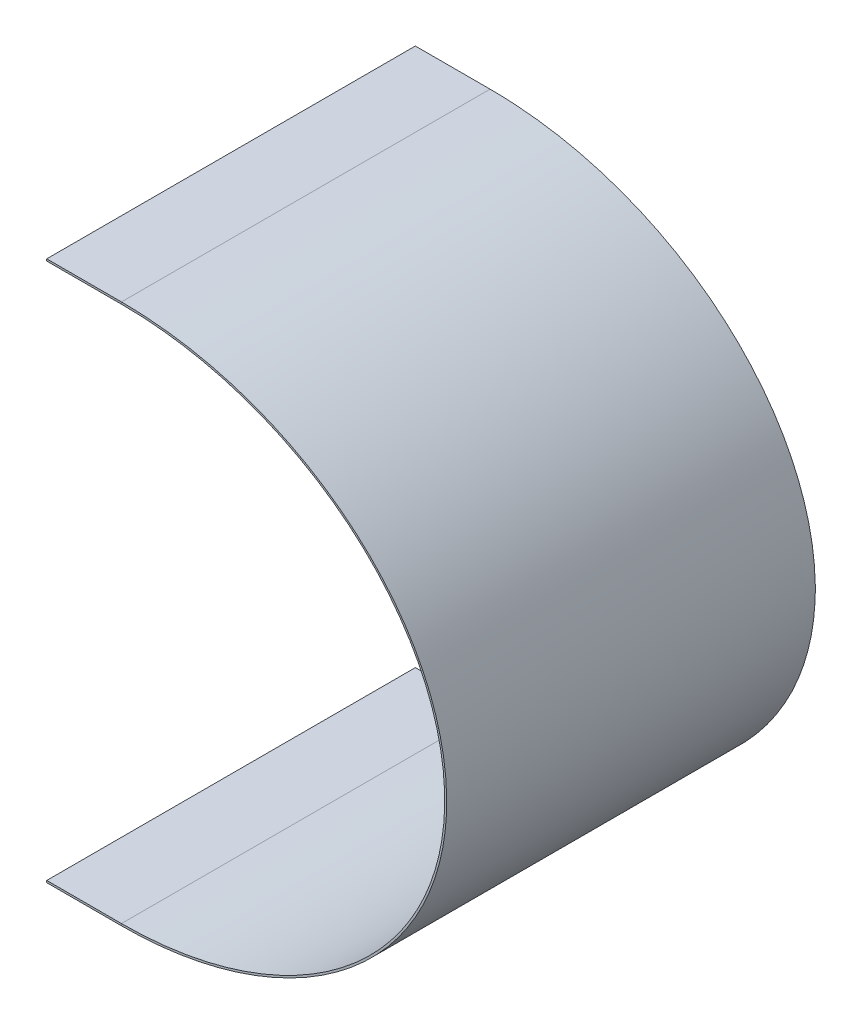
ISO-10303-21;
HEADER;
FILE_DESCRIPTION(('STEP AP214'),'2;1');
FILE_NAME('part.step','',(''),(''),'','','');
FILE_SCHEMA(('AUTOMOTIVE_DESIGN { 1 0 10303 214 1 1 1 1 }'));
ENDSEC;
DATA;
#1=APPLICATION_CONTEXT('core data for automotive mechanical design processes');
#2=APPLICATION_PROTOCOL_DEFINITION('international standard','automotive_design',2000,#1);
#3=PRODUCT_CONTEXT('',#1,'mechanical');
#4=PRODUCT('Part','Part','',(#3));
#5=PRODUCT_RELATED_PRODUCT_CATEGORY('part','',(#4));
#6=PRODUCT_DEFINITION_FORMATION('','',#4);
#7=PRODUCT_DEFINITION_CONTEXT('part definition',#1,'design');
#8=PRODUCT_DEFINITION('design','',#6,#7);
#9=PRODUCT_DEFINITION_SHAPE('','',#8);
#10=(LENGTH_UNIT() NAMED_UNIT(*) SI_UNIT(.MILLI.,.METRE.));
#11=(NAMED_UNIT(*) PLANE_ANGLE_UNIT() SI_UNIT($,.RADIAN.));
#12=(NAMED_UNIT(*) SI_UNIT($,.STERADIAN.) SOLID_ANGLE_UNIT());
#13=UNCERTAINTY_MEASURE_WITH_UNIT(LENGTH_MEASURE(1.E-05),#10,'distance_accuracy_value','');
#14=(GEOMETRIC_REPRESENTATION_CONTEXT(3) GLOBAL_UNCERTAINTY_ASSIGNED_CONTEXT((#13)) GLOBAL_UNIT_ASSIGNED_CONTEXT((#10,
#11,#12)) REPRESENTATION_CONTEXT('',''));
#15=CARTESIAN_POINT('',(0.,0.,0.));
#16=DIRECTION('',(0.,0.,1.));
#17=DIRECTION('',(1.,0.,0.));
#18=AXIS2_PLACEMENT_3D('',#15,#16,#17);
#19=CARTESIAN_POINT('',(0.,-161.52197322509,0.));
#20=DIRECTION('',(0.,0.,1.));
#21=DIRECTION('',(-1.,0.,0.));
#22=AXIS2_PLACEMENT_3D('',#19,#20,#21);
#23=PLANE('',#22);
#24=DIRECTION('',(0.,-1.,0.));
#25=VECTOR('',#24,1.);
#26=CARTESIAN_POINT('',(-45.,-161.52197322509,0.));
#27=LINE('',#26,#25);
#28=CARTESIAN_POINT('',(-45.,-161.52197322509,0.));
#29=VERTEX_POINT('',#28);
#30=CARTESIAN_POINT('',(-45.,-162.71197322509,0.));
#31=VERTEX_POINT('',#30);
#32=EDGE_CURVE('E14',#29,#31,#27,.T.);
#33=ORIENTED_EDGE('',*,*,#32,.F.);
#34=DIRECTION('',(-1.,0.,0.));
#35=VECTOR('',#34,1.);
#36=CARTESIAN_POINT('',(0.,-161.52197322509,0.));
#37=LINE('',#36,#35);
#38=CARTESIAN_POINT('',(0.,-161.52197322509,0.));
#39=VERTEX_POINT('',#38);
#40=EDGE_CURVE('E201',#39,#29,#37,.T.);
#41=ORIENTED_EDGE('',*,*,#40,.F.);
#42=DIRECTION('',(0.,-1.,0.));
#43=VECTOR('',#42,1.);
#44=CARTESIAN_POINT('',(0.,-161.52197322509,0.));
#45=LINE('',#44,#43);
#46=CARTESIAN_POINT('',(0.,-162.71197322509,0.));
#47=VERTEX_POINT('',#46);
#48=EDGE_CURVE('E69',#39,#47,#45,.T.);
#49=ORIENTED_EDGE('',*,*,#48,.T.);
#50=DIRECTION('',(1.,0.,0.));
#51=VECTOR('',#50,1.);
#52=CARTESIAN_POINT('',(0.,-162.71197322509,0.));
#53=LINE('',#52,#51);
#54=EDGE_CURVE('E117',#47,#31,#53,.F.);
#55=ORIENTED_EDGE('',*,*,#54,.T.);
#56=EDGE_LOOP('',(#33,#41,#49,#55));
#57=FACE_BOUND('',#56,.T.);
#58=ADVANCED_FACE('F59',(#57),#23,.F.);
#59=CARTESIAN_POINT('',(0.,-161.52197322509,0.));
#60=DIRECTION('',(0.,0.,-1.));
#61=DIRECTION('',(-1.,0.,0.));
#62=AXIS2_PLACEMENT_3D('',#59,#60,#61);
#63=PLANE('',#62);
#64=ORIENTED_EDGE('',*,*,#48,.F.);
#65=CARTESIAN_POINT('',(0.,-161.52197322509,0.));
#66=CARTESIAN_POINT('',(51.6352629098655,-161.52197322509,0.));
#67=CARTESIAN_POINT('',(101.159576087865,-144.503671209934,0.));
#68=CARTESIAN_POINT('',(174.182865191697,-83.9228939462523,0.));
#69=CARTESIAN_POINT('',(194.696507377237,-42.8370784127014,0.));
#70=CARTESIAN_POINT('',(194.696507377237,42.8370784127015,0.));
#71=CARTESIAN_POINT('',(174.182865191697,83.9228939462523,0.));
#72=CARTESIAN_POINT('',(101.159576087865,144.503671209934,0.));
#73=CARTESIAN_POINT('',(51.6352629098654,161.52197322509,0.));
#74=CARTESIAN_POINT('',(0.,161.52197322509,0.));
#75=B_SPLINE_CURVE_WITH_KNOTS('',3,(#65,#66,#67,#68,#69,#70,#71,#72,#73,#74),.UNSPECIFIED.,.F.,
.F.,(4,2,2,2,4),(0.,0.25,0.5,0.75,1.),.UNSPECIFIED.);
#76=CARTESIAN_POINT('',(0.,161.52197322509,0.));
#77=VERTEX_POINT('',#76);
#78=EDGE_CURVE('E147',#39,#77,#75,.T.);
#79=ORIENTED_EDGE('',*,*,#78,.T.);
#80=DIRECTION('',(0.,1.,0.));
#81=VECTOR('',#80,1.);
#82=CARTESIAN_POINT('',(0.,161.52197322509,0.));
#83=LINE('',#82,#81);
#84=CARTESIAN_POINT('',(0.,162.71197322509,0.));
#85=VERTEX_POINT('',#84);
#86=EDGE_CURVE('E138',#77,#85,#83,.T.);
#87=ORIENTED_EDGE('',*,*,#86,.T.);
#88=CARTESIAN_POINT('',(-2.665259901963E-11,-162.71197322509,7.43899436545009E-11));
#89=CARTESIAN_POINT('',(3.23528703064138,-162.711974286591,-3.34634409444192E-12));
#90=CARTESIAN_POINT('',(6.4705901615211,-162.645497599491,-1.40137352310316E-11));
#91=CARTESIAN_POINT('',(12.9192802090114,-162.380074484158,1.39425046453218E-11));
#92=CARTESIAN_POINT('',(16.1326949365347,-162.181803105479,5.23158693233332E-11));
#93=CARTESIAN_POINT('',(22.5322733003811,-161.654626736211,9.43273594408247E-11));
#94=CARTESIAN_POINT('',(25.7184922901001,-161.326394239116,9.81419225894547E-11));
#95=CARTESIAN_POINT('',(32.0583321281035,-160.541124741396,4.96351336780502E-11));
#96=CARTESIAN_POINT('',(35.2120363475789,-160.08476121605,-2.3966142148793E-12));
#97=CARTESIAN_POINT('',(41.4815034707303,-159.04505086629,-3.6852034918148E-12));
#98=CARTESIAN_POINT('',(44.5973785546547,-158.462380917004,4.65216563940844E-11));
#99=CARTESIAN_POINT('',(50.7858423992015,-157.171872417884,9.89853341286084E-11));
#100=CARTESIAN_POINT('',(53.8585731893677,-156.464715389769,1.01495512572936E-10));
#101=CARTESIAN_POINT('',(59.9554018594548,-154.927041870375,2.47822955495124E-11));
#102=CARTESIAN_POINT('',(62.9796726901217,-154.097211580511,-5.4000161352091E-11));
#103=CARTESIAN_POINT('',(68.9742321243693,-152.315996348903,-1.09652866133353E-10));
#104=CARTESIAN_POINT('',(71.9447255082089,-151.365301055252,-8.70781507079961E-11));
#105=CARTESIAN_POINT('',(77.8263774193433,-149.344157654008,-5.37183525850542E-11));
#106=CARTESIAN_POINT('',(80.7377730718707,-148.274400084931,-4.2868831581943E-11));
#107=CARTESIAN_POINT('',(86.495873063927,-146.016932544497,1.55538105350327E-11));
#108=CARTESIAN_POINT('',(89.3428467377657,-144.829910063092,6.2922809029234E-11));
#109=CARTESIAN_POINT('',(94.9667422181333,-142.339713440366,7.30892420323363E-11));
#110=CARTESIAN_POINT('',(97.7439644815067,-141.037218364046,3.63531987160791E-11));
#111=CARTESIAN_POINT('',(103.222992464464,-138.317879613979,-3.61545365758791E-11));
#112=CARTESIAN_POINT('',(105.925127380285,-136.901699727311,-7.19304014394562E-11));
#113=CARTESIAN_POINT('',(111.248612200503,-133.956799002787,-5.82935766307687E-11));
#114=CARTESIAN_POINT('',(113.870315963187,-132.428718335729,-9.33398899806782E-12));
#115=CARTESIAN_POINT('',(119.027566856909,-129.261830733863,9.28621400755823E-12));
#116=CARTESIAN_POINT('',(121.563486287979,-127.623630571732,-2.06485702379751E-11));
#117=CARTESIAN_POINT('',(126.543795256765,-124.238328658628,-4.08252787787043E-11));
#118=CARTESIAN_POINT('',(128.988566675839,-122.49178917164,-3.12576056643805E-11));
#119=CARTESIAN_POINT('',(133.781205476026,-118.89164546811,-2.82272890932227E-11));
#120=CARTESIAN_POINT('',(136.129452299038,-117.03854679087,-3.46938848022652E-11));
#121=CARTESIAN_POINT('',(140.712044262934,-113.236787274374,-2.26129661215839E-11));
#122=CARTESIAN_POINT('',(142.947219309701,-111.28912762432,-4.28832055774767E-12));
#123=CARTESIAN_POINT('',(147.288611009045,-107.311436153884,4.23117053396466E-12));
#124=CARTESIAN_POINT('',(149.396149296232,-105.282848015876,-5.20235544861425E-12));
#125=CARTESIAN_POINT('',(153.479997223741,-101.147847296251,5.13670465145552E-12));
#126=CARTESIAN_POINT('',(155.457627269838,-99.0427398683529,2.45422283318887E-11));
#127=CARTESIAN_POINT('',(159.279398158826,-94.759253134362,2.49800605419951E-11));
#128=CARTESIAN_POINT('',(161.124844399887,-92.5820394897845,6.46491613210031E-12));
#129=CARTESIAN_POINT('',(164.679997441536,-88.1588981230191,-6.39344766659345E-12));
#130=CARTESIAN_POINT('',(166.390979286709,-85.9139960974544,-1.00162054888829E-12));
#131=CARTESIAN_POINT('',(169.674965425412,-81.3600416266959,9.9142115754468E-13));
#132=CARTESIAN_POINT('',(171.249197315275,-79.0518751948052,-2.31840950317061E-12));
#133=CARTESIAN_POINT('',(174.257459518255,-74.3759618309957,2.29698481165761E-12));
#134=CARTESIAN_POINT('',(175.692651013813,-72.008962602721,1.01186679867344E-11));
#135=CARTESIAN_POINT('',(178.420624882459,-67.2199600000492,-1.00354714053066E-11));
#136=CARTESIAN_POINT('',(179.714481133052,-64.7985688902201,-3.77174924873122E-11));
#137=CARTESIAN_POINT('',(182.157596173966,-59.9053651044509,-7.86319046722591E-11));
#138=CARTESIAN_POINT('',(183.307818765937,-57.4340340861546,-9.19657581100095E-11));
#139=CARTESIAN_POINT('',(185.461500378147,-52.4455385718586,-4.47680884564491E-11));
#140=CARTESIAN_POINT('',(186.465788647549,-49.9287324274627,1.53262203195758E-11));
#141=CARTESIAN_POINT('',(188.325460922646,-44.8538788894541,-1.52551558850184E-11));
#142=CARTESIAN_POINT('',(189.181513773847,-42.2960768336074,-1.05233044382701E-10));
#143=CARTESIAN_POINT('',(190.742603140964,-37.1438257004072,-1.7942120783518E-10));
#144=CARTESIAN_POINT('',(191.448121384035,-34.54952273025,-1.63974252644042E-10));
#145=CARTESIAN_POINT('',(192.706061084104,-29.3288629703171,-1.16635163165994E-10));
#146=CARTESIAN_POINT('',(193.258750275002,-26.7025707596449,-8.47720716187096E-11));
#147=CARTESIAN_POINT('',(194.208985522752,-21.4225207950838,-6.165750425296E-11));
#148=CARTESIAN_POINT('',(194.606559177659,-18.7687680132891,-7.03988005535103E-11));
#149=CARTESIAN_POINT('',(195.244552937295,-13.4383753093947,-7.73319158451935E-11));
#150=CARTESIAN_POINT('',(195.484736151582,-10.7617070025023,-7.55078732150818E-11));
#151=CARTESIAN_POINT('',(195.805974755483,-5.39004666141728,-7.30025924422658E-11));
#152=CARTESIAN_POINT('',(195.886507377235,-2.69502333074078,-7.23251097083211E-11));
#153=CARTESIAN_POINT('',(195.886507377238,2.69502333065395,-7.64547776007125E-11));
#154=CARTESIAN_POINT('',(195.805974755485,5.39004666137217,-8.12619282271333E-11));
#155=CARTESIAN_POINT('',(195.484736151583,10.7617070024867,-6.72754498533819E-11));
#156=CARTESIAN_POINT('',(195.244552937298,13.4383753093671,-4.85586711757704E-11));
#157=CARTESIAN_POINT('',(194.606559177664,18.7687680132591,-9.91289018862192E-11));
#158=CARTESIAN_POINT('',(194.208985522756,21.4225207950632,-1.68283998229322E-10));
#159=CARTESIAN_POINT('',(193.258750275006,26.7025707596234,-1.24567147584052E-10));
#160=CARTESIAN_POINT('',(192.706061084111,29.3288629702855,-1.16627917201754E-11));
#161=CARTESIAN_POINT('',(191.448121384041,34.5495227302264,2.04040140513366E-11));
#162=CARTESIAN_POINT('',(190.742603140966,37.1438257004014,-6.0776080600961E-11));
#163=CARTESIAN_POINT('',(189.181513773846,42.2960768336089,-8.1645382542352E-11));
#164=CARTESIAN_POINT('',(188.325460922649,44.8538788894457,-2.08724153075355E-11));
#165=CARTESIAN_POINT('',(186.465788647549,49.9287324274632,2.09696471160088E-11));
#166=CARTESIAN_POINT('',(185.46150037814,52.4455385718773,1.6661319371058E-12));
#167=CARTESIAN_POINT('',(183.307818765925,57.4340340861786,-1.67606329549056E-12));
#168=CARTESIAN_POINT('',(182.15759617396,59.9053651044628,1.44961465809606E-11));
#169=CARTESIAN_POINT('',(179.714481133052,64.798568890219,2.07461309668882E-12));
#170=CARTESIAN_POINT('',(178.420624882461,67.219960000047,-2.68409301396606E-11));
#171=CARTESIAN_POINT('',(175.69265101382,72.0089626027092,-6.57765388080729E-11));
#172=CARTESIAN_POINT('',(174.257459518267,74.3759618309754,-7.56379686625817E-11));
#173=CARTESIAN_POINT('',(171.249197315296,79.0518751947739,-4.93622610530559E-11));
#174=CARTESIAN_POINT('',(169.674965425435,81.3600416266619,-1.2795222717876E-11));
#175=CARTESIAN_POINT('',(166.39097928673,85.9139960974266,1.29268554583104E-11));
#176=CARTESIAN_POINT('',(164.679997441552,88.1588981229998,1.59026727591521E-12));
#177=CARTESIAN_POINT('',(161.124844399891,92.5820394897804,-1.60804390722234E-12));
#178=CARTESIAN_POINT('',(159.279398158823,94.7592531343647,6.7493473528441E-12));
#179=CARTESIAN_POINT('',(155.457627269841,99.0427398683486,-6.83038641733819E-12));
#180=CARTESIAN_POINT('',(153.479997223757,101.147847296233,-2.91324609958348E-11));
#181=CARTESIAN_POINT('',(149.396149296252,105.282848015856,-2.31024937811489E-11));
#182=CARTESIAN_POINT('',(147.288611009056,107.311436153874,5.88033158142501E-12));
#183=CARTESIAN_POINT('',(142.947219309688,111.289127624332,-5.95975666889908E-12));
#184=CARTESIAN_POINT('',(140.712044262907,113.236787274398,-4.77308173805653E-11));
#185=CARTESIAN_POINT('',(136.129452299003,117.038546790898,-4.72617310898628E-11));
#186=CARTESIAN_POINT('',(133.781205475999,118.891645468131,-4.26118338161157E-12));
#187=CARTESIAN_POINT('',(128.988566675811,122.491789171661,4.28003797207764E-12));
#188=CARTESIAN_POINT('',(126.543795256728,124.238328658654,-3.05228693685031E-11));
#189=CARTESIAN_POINT('',(121.563486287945,127.623630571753,-7.29211235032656E-11));
#190=CARTESIAN_POINT('',(119.02756685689,129.261830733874,-8.03840346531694E-11));
#191=CARTESIAN_POINT('',(113.870315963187,132.428718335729,-8.53398144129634E-11));
#192=CARTESIAN_POINT('',(111.248612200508,133.956799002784,-8.27811923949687E-11));
#193=CARTESIAN_POINT('',(105.925127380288,136.901699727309,-4.73115487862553E-11));
#194=CARTESIAN_POINT('',(103.222992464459,138.317879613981,-1.42379325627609E-11));
#195=CARTESIAN_POINT('',(97.7439644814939,141.037218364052,1.43161672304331E-11));
#196=CARTESIAN_POINT('',(94.9667422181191,142.339713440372,9.58908526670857E-12));
#197=CARTESIAN_POINT('',(89.3428467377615,144.829910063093,-3.98447645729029E-11));
#198=CARTESIAN_POINT('',(86.4958730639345,146.016932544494,-8.47738426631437E-11));
#199=CARTESIAN_POINT('',(80.7377730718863,148.274400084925,-8.0882884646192E-11));
#200=CARTESIAN_POINT('',(77.826377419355,149.344157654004,-3.15383089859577E-11));
#201=CARTESIAN_POINT('',(71.9447255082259,151.365301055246,7.47090429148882E-12));
#202=CARTESIAN_POINT('',(68.9742321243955,152.315996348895,-3.197490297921E-12));
#203=CARTESIAN_POINT('',(62.9796726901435,154.097211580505,-1.80317134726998E-11));
#204=CARTESIAN_POINT('',(59.9554018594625,154.927041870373,-2.21614590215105E-11));
#205=CARTESIAN_POINT('',(53.8585731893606,156.464715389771,1.31609517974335E-11));
#206=CARTESIAN_POINT('',(50.7858423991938,157.171872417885,5.28496612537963E-11));
#207=CARTESIAN_POINT('',(44.597378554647,158.462380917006,8.52904014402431E-11));
#208=CARTESIAN_POINT('',(41.4815034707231,159.045050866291,7.77905738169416E-11));
#209=CARTESIAN_POINT('',(35.2120363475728,160.084761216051,6.89615417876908E-11));
#210=CARTESIAN_POINT('',(32.058332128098,160.541124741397,6.7664999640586E-11));
#211=CARTESIAN_POINT('',(25.718492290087,161.326394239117,7.77265308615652E-11));
#212=CARTESIAN_POINT('',(22.5322733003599,161.654626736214,8.91502857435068E-11));
#213=CARTESIAN_POINT('',(16.1326949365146,162.18180310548,5.90502739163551E-11));
#214=CARTESIAN_POINT('',(12.9192802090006,162.380074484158,1.72543438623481E-11));
#215=CARTESIAN_POINT('',(6.4705901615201,162.645497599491,-1.73424942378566E-11));
#216=CARTESIAN_POINT('',(3.23528703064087,162.711974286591,-9.8920016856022E-12));
#217=CARTESIAN_POINT('',(-2.66883641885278E-11,162.71197322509,7.43899436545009E-11));
#218=B_SPLINE_CURVE_WITH_KNOTS('',3,(#88,#89,#90,#91,#92,#93,#94,#95,#96,#97,#98,#99,#100,#101,
#102,#103,#104,#105,#106,#107,#108,#109,#110,#111,#112,#113,#114,#115,#116,#117,#118,#119,#120,
#121,#122,#123,#124,#125,#126,#127,#128,#129,#130,#131,#132,#133,#134,#135,#136,#137,#138,#139,
#140,#141,#142,#143,#144,#145,#146,#147,#148,#149,#150,#151,#152,#153,#154,#155,#156,#157,#158,
#159,#160,#161,#162,#163,#164,#165,#166,#167,#168,#169,#170,#171,#172,#173,#174,#175,#176,#177,
#178,#179,#180,#181,#182,#183,#184,#185,#186,#187,#188,#189,#190,#191,#192,#193,#194,#195,#196,
#197,#198,#199,#200,#201,#202,#203,#204,#205,#206,#207,#208,#209,#210,#211,#212,#213,#214,#215,
#216,#217),.UNSPECIFIED.,.F.,.F.,(4,2,2,2,2,2,2,2,2,2,2,2,2,2,2,2,2,2,2,2,2,2,2,2,2,2,2,2,2,2,2,
2,2,2,2,2,2,2,2,2,2,2,2,2,2,2,2,2,2,2,2,2,2,2,2,2,2,2,2,2,2,2,2,2,4),(0.,9.70520179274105,
19.3610728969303,28.9676186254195,38.5245869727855,48.0315528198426,57.4880042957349,
66.8934313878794,76.2474169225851,85.5497300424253,94.8004222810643,103.999926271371,
113.149157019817,122.249615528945,131.303494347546,140.313784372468,149.284381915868,
158.174868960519,166.946873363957,175.608180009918,184.166724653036,192.630656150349,
201.008400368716,209.308724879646,217.540803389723,225.714278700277,233.839322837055,
241.926692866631,249.987780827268,258.034656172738,266.080099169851,274.137623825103,
282.221489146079,290.30535446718,298.362879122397,306.408322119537,314.455197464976,
322.516285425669,330.603655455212,338.72869959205,346.902174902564,355.134253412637,
363.434577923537,371.812322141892,380.276253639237,388.834798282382,397.496104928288,
406.268109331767,415.158596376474,424.129193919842,433.139483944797,442.193362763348,
451.293821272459,460.443052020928,469.64255601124,478.893248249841,488.195561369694,
497.54954690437,506.954973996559,516.411425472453,525.918391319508,535.475359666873,
545.081905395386,554.737776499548,564.442978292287),.UNSPECIFIED.);
#219=EDGE_CURVE('E126',#47,#85,#218,.T.);
#220=ORIENTED_EDGE('',*,*,#219,.F.);
#221=EDGE_LOOP('',(#64,#79,#87,#220));
#222=FACE_BOUND('',#221,.T.);
#223=ADVANCED_FACE('F144',(#222),#63,.T.);
#224=CARTESIAN_POINT('',(0.,161.52197322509,0.));
#225=DIRECTION('',(0.,0.,1.));
#226=DIRECTION('',(1.,0.,0.));
#227=AXIS2_PLACEMENT_3D('',#224,#225,#226);
#228=PLANE('',#227);
#229=ORIENTED_EDGE('',*,*,#86,.F.);
#230=DIRECTION('',(1.,0.,0.));
#231=VECTOR('',#230,1.);
#232=CARTESIAN_POINT('',(0.,161.52197322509,0.));
#233=LINE('',#232,#231);
#234=CARTESIAN_POINT('',(-45.0000000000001,161.52197322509,0.));
#235=VERTEX_POINT('',#234);
#236=EDGE_CURVE('E237',#235,#77,#233,.T.);
#237=ORIENTED_EDGE('',*,*,#236,.F.);
#238=DIRECTION('',(0.,1.,0.));
#239=VECTOR('',#238,1.);
#240=CARTESIAN_POINT('',(-45.0000000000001,161.52197322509,0.));
#241=LINE('',#240,#239);
#242=CARTESIAN_POINT('',(-45.0000000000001,162.71197322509,0.));
#243=VERTEX_POINT('',#242);
#244=EDGE_CURVE('E136',#235,#243,#241,.T.);
#245=ORIENTED_EDGE('',*,*,#244,.T.);
#246=DIRECTION('',(1.,0.,0.));
#247=VECTOR('',#246,1.);
#248=CARTESIAN_POINT('',(-45.0000000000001,162.71197322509,0.));
#249=LINE('',#248,#247);
#250=EDGE_CURVE('E159',#243,#85,#249,.T.);
#251=ORIENTED_EDGE('',*,*,#250,.T.);
#252=EDGE_LOOP('',(#229,#237,#245,#251));
#253=FACE_BOUND('',#252,.T.);
#254=ADVANCED_FACE('F160',(#253),#228,.F.);
#255=CARTESIAN_POINT('',(-45.0000000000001,161.52197322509,0.));
#256=DIRECTION('',(-1.,0.,0.));
#257=DIRECTION('',(0.,0.,1.));
#258=AXIS2_PLACEMENT_3D('',#255,#256,#257);
#259=PLANE('',#258);
#260=ORIENTED_EDGE('',*,*,#244,.F.);
#261=DIRECTION('',(0.,0.,1.));
#262=VECTOR('',#261,1.);
#263=CARTESIAN_POINT('',(-45.0000000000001,161.52197322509,0.));
#264=LINE('',#263,#262);
#265=CARTESIAN_POINT('',(-45.0000000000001,161.52197322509,222.));
#266=VERTEX_POINT('',#265);
#267=EDGE_CURVE('E230',#235,#266,#264,.T.);
#268=ORIENTED_EDGE('',*,*,#267,.T.);
#269=DIRECTION('',(0.,1.,0.));
#270=VECTOR('',#269,1.);
#271=CARTESIAN_POINT('',(-45.0000000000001,161.52197322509,222.));
#272=LINE('',#271,#270);
#273=CARTESIAN_POINT('',(-45.0000000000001,162.71197322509,222.));
#274=VERTEX_POINT('',#273);
#275=EDGE_CURVE('E134',#266,#274,#272,.T.);
#276=ORIENTED_EDGE('',*,*,#275,.T.);
#277=DIRECTION('',(0.,0.,1.));
#278=VECTOR('',#277,1.);
#279=CARTESIAN_POINT('',(-45.0000000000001,162.71197322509,222.));
#280=LINE('',#279,#278);
#281=EDGE_CURVE('E200',#243,#274,#280,.T.);
#282=ORIENTED_EDGE('',*,*,#281,.F.);
#283=EDGE_LOOP('',(#260,#268,#276,#282));
#284=FACE_BOUND('',#283,.T.);
#285=ADVANCED_FACE('F256',(#284),#259,.T.);
#286=CARTESIAN_POINT('',(0.,161.52197322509,222.));
#287=DIRECTION('',(0.,0.,1.));
#288=DIRECTION('',(1.,0.,0.));
#289=AXIS2_PLACEMENT_3D('',#286,#287,#288);
#290=PLANE('',#289);
#291=ORIENTED_EDGE('',*,*,#275,.F.);
#292=DIRECTION('',(1.,0.,0.));
#293=VECTOR('',#292,1.);
#294=CARTESIAN_POINT('',(0.,161.52197322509,222.));
#295=LINE('',#294,#293);
#296=CARTESIAN_POINT('',(0.,161.52197322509,222.));
#297=VERTEX_POINT('',#296);
#298=EDGE_CURVE('E244',#266,#297,#295,.T.);
#299=ORIENTED_EDGE('',*,*,#298,.T.);
#300=DIRECTION('',(0.,1.,0.));
#301=VECTOR('',#300,1.);
#302=CARTESIAN_POINT('',(0.,161.52197322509,222.));
#303=LINE('',#302,#301);
#304=CARTESIAN_POINT('',(0.,162.71197322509,222.));
#305=VERTEX_POINT('',#304);
#306=EDGE_CURVE('E132',#297,#305,#303,.T.);
#307=ORIENTED_EDGE('',*,*,#306,.T.);
#308=DIRECTION('',(1.,0.,0.));
#309=VECTOR('',#308,1.);
#310=CARTESIAN_POINT('',(-45.0000000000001,162.71197322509,222.));
#311=LINE('',#310,#309);
#312=EDGE_CURVE('E166',#274,#305,#311,.T.);
#313=ORIENTED_EDGE('',*,*,#312,.F.);
#314=EDGE_LOOP('',(#291,#299,#307,#313));
#315=FACE_BOUND('',#314,.T.);
#316=ADVANCED_FACE('F286',(#315),#290,.T.);
#317=CARTESIAN_POINT('',(0.,161.52197322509,222.));
#318=DIRECTION('',(0.,0.,-1.));
#319=DIRECTION('',(-1.,0.,0.));
#320=AXIS2_PLACEMENT_3D('',#317,#318,#319);
#321=PLANE('',#320);
#322=ORIENTED_EDGE('',*,*,#306,.F.);
#323=CARTESIAN_POINT('',(0.,-161.52197322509,222.));
#324=CARTESIAN_POINT('',(51.6352629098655,-161.52197322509,222.));
#325=CARTESIAN_POINT('',(101.159576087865,-144.503671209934,222.));
#326=CARTESIAN_POINT('',(174.182865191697,-83.9228939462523,222.));
#327=CARTESIAN_POINT('',(194.696507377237,-42.8370784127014,222.));
#328=CARTESIAN_POINT('',(194.696507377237,42.8370784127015,222.));
#329=CARTESIAN_POINT('',(174.182865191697,83.9228939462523,222.));
#330=CARTESIAN_POINT('',(101.159576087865,144.503671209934,222.));
#331=CARTESIAN_POINT('',(51.6352629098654,161.52197322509,222.));
#332=CARTESIAN_POINT('',(0.,161.52197322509,222.));
#333=B_SPLINE_CURVE_WITH_KNOTS('',3,(#323,#324,#325,#326,#327,#328,#329,#330,#331,#332),
.UNSPECIFIED.,.F.,.F.,(4,2,2,2,4),(0.,0.25,0.5,0.75,1.),.UNSPECIFIED.);
#334=CARTESIAN_POINT('',(0.,-161.52197322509,222.));
#335=VERTEX_POINT('',#334);
#336=EDGE_CURVE('E226',#297,#335,#333,.F.);
#337=ORIENTED_EDGE('',*,*,#336,.T.);
#338=DIRECTION('',(0.,-1.,0.));
#339=VECTOR('',#338,1.);
#340=CARTESIAN_POINT('',(0.,-161.52197322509,222.));
#341=LINE('',#340,#339);
#342=CARTESIAN_POINT('',(0.,-162.71197322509,222.));
#343=VERTEX_POINT('',#342);
#344=EDGE_CURVE('E76',#335,#343,#341,.T.);
#345=ORIENTED_EDGE('',*,*,#344,.T.);
#346=CARTESIAN_POINT('',(-2.665259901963E-11,-162.71197322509,222.));
#347=CARTESIAN_POINT('',(3.23528703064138,-162.711974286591,222.));
#348=CARTESIAN_POINT('',(6.4705901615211,-162.645497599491,222.));
#349=CARTESIAN_POINT('',(12.9192802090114,-162.380074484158,222.));
#350=CARTESIAN_POINT('',(16.1326949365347,-162.181803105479,222.));
#351=CARTESIAN_POINT('',(22.5322733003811,-161.654626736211,222.));
#352=CARTESIAN_POINT('',(25.7184922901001,-161.326394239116,222.));
#353=CARTESIAN_POINT('',(32.0583321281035,-160.541124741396,222.));
#354=CARTESIAN_POINT('',(35.2120363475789,-160.08476121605,222.));
#355=CARTESIAN_POINT('',(41.4815034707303,-159.04505086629,222.));
#356=CARTESIAN_POINT('',(44.5973785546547,-158.462380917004,222.));
#357=CARTESIAN_POINT('',(50.7858423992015,-157.171872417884,222.));
#358=CARTESIAN_POINT('',(53.8585731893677,-156.464715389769,222.));
#359=CARTESIAN_POINT('',(59.9554018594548,-154.927041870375,222.));
#360=CARTESIAN_POINT('',(62.9796726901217,-154.097211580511,222.));
#361=CARTESIAN_POINT('',(68.9742321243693,-152.315996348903,222.));
#362=CARTESIAN_POINT('',(71.9447255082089,-151.365301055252,222.));
#363=CARTESIAN_POINT('',(77.8263774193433,-149.344157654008,222.));
#364=CARTESIAN_POINT('',(80.7377730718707,-148.274400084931,222.));
#365=CARTESIAN_POINT('',(86.495873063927,-146.016932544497,222.));
#366=CARTESIAN_POINT('',(89.3428467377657,-144.829910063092,222.));
#367=CARTESIAN_POINT('',(94.9667422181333,-142.339713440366,222.));
#368=CARTESIAN_POINT('',(97.7439644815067,-141.037218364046,222.));
#369=CARTESIAN_POINT('',(103.222992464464,-138.317879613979,222.));
#370=CARTESIAN_POINT('',(105.925127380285,-136.901699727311,222.));
#371=CARTESIAN_POINT('',(111.248612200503,-133.956799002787,222.));
#372=CARTESIAN_POINT('',(113.870315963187,-132.428718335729,222.));
#373=CARTESIAN_POINT('',(119.027566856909,-129.261830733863,222.));
#374=CARTESIAN_POINT('',(121.563486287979,-127.623630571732,222.));
#375=CARTESIAN_POINT('',(126.543795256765,-124.238328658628,222.));
#376=CARTESIAN_POINT('',(128.988566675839,-122.49178917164,222.));
#377=CARTESIAN_POINT('',(133.781205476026,-118.89164546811,222.));
#378=CARTESIAN_POINT('',(136.129452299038,-117.03854679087,222.));
#379=CARTESIAN_POINT('',(140.712044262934,-113.236787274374,222.));
#380=CARTESIAN_POINT('',(142.947219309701,-111.28912762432,222.));
#381=CARTESIAN_POINT('',(147.288611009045,-107.311436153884,222.));
#382=CARTESIAN_POINT('',(149.396149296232,-105.282848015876,222.));
#383=CARTESIAN_POINT('',(153.479997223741,-101.147847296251,222.));
#384=CARTESIAN_POINT('',(155.457627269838,-99.0427398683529,222.));
#385=CARTESIAN_POINT('',(159.279398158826,-94.759253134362,222.));
#386=CARTESIAN_POINT('',(161.124844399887,-92.5820394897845,222.));
#387=CARTESIAN_POINT('',(164.679997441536,-88.1588981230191,222.));
#388=CARTESIAN_POINT('',(166.390979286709,-85.9139960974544,222.));
#389=CARTESIAN_POINT('',(169.674965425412,-81.3600416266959,222.));
#390=CARTESIAN_POINT('',(171.249197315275,-79.0518751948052,222.));
#391=CARTESIAN_POINT('',(174.257459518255,-74.3759618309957,222.));
#392=CARTESIAN_POINT('',(175.692651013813,-72.008962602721,222.));
#393=CARTESIAN_POINT('',(178.420624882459,-67.2199600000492,222.));
#394=CARTESIAN_POINT('',(179.714481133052,-64.7985688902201,222.));
#395=CARTESIAN_POINT('',(182.157596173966,-59.9053651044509,222.));
#396=CARTESIAN_POINT('',(183.307818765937,-57.4340340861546,222.));
#397=CARTESIAN_POINT('',(185.461500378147,-52.4455385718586,222.));
#398=CARTESIAN_POINT('',(186.465788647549,-49.9287324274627,222.));
#399=CARTESIAN_POINT('',(188.325460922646,-44.8538788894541,222.));
#400=CARTESIAN_POINT('',(189.181513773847,-42.2960768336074,222.));
#401=CARTESIAN_POINT('',(190.742603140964,-37.1438257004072,222.));
#402=CARTESIAN_POINT('',(191.448121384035,-34.54952273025,222.));
#403=CARTESIAN_POINT('',(192.706061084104,-29.3288629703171,222.));
#404=CARTESIAN_POINT('',(193.258750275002,-26.7025707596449,222.));
#405=CARTESIAN_POINT('',(194.208985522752,-21.4225207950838,222.));
#406=CARTESIAN_POINT('',(194.606559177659,-18.7687680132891,222.));
#407=CARTESIAN_POINT('',(195.244552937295,-13.4383753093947,222.));
#408=CARTESIAN_POINT('',(195.484736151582,-10.7617070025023,222.));
#409=CARTESIAN_POINT('',(195.805974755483,-5.39004666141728,222.));
#410=CARTESIAN_POINT('',(195.886507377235,-2.69502333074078,222.));
#411=CARTESIAN_POINT('',(195.886507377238,2.69502333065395,222.));
#412=CARTESIAN_POINT('',(195.805974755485,5.39004666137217,222.));
#413=CARTESIAN_POINT('',(195.484736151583,10.7617070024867,222.));
#414=CARTESIAN_POINT('',(195.244552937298,13.4383753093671,222.));
#415=CARTESIAN_POINT('',(194.606559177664,18.7687680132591,222.));
#416=CARTESIAN_POINT('',(194.208985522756,21.4225207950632,222.));
#417=CARTESIAN_POINT('',(193.258750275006,26.7025707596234,222.));
#418=CARTESIAN_POINT('',(192.706061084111,29.3288629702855,222.));
#419=CARTESIAN_POINT('',(191.448121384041,34.5495227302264,222.));
#420=CARTESIAN_POINT('',(190.742603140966,37.1438257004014,222.));
#421=CARTESIAN_POINT('',(189.181513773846,42.2960768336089,222.));
#422=CARTESIAN_POINT('',(188.325460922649,44.8538788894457,222.));
#423=CARTESIAN_POINT('',(186.465788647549,49.9287324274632,222.));
#424=CARTESIAN_POINT('',(185.46150037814,52.4455385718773,222.));
#425=CARTESIAN_POINT('',(183.307818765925,57.4340340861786,222.));
#426=CARTESIAN_POINT('',(182.15759617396,59.9053651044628,222.));
#427=CARTESIAN_POINT('',(179.714481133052,64.798568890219,222.));
#428=CARTESIAN_POINT('',(178.420624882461,67.219960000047,222.));
#429=CARTESIAN_POINT('',(175.69265101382,72.0089626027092,222.));
#430=CARTESIAN_POINT('',(174.257459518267,74.3759618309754,222.));
#431=CARTESIAN_POINT('',(171.249197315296,79.0518751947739,222.));
#432=CARTESIAN_POINT('',(169.674965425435,81.3600416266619,222.));
#433=CARTESIAN_POINT('',(166.39097928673,85.9139960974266,222.));
#434=CARTESIAN_POINT('',(164.679997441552,88.1588981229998,222.));
#435=CARTESIAN_POINT('',(161.124844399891,92.5820394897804,222.));
#436=CARTESIAN_POINT('',(159.279398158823,94.7592531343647,222.));
#437=CARTESIAN_POINT('',(155.457627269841,99.0427398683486,222.));
#438=CARTESIAN_POINT('',(153.479997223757,101.147847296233,222.));
#439=CARTESIAN_POINT('',(149.396149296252,105.282848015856,222.));
#440=CARTESIAN_POINT('',(147.288611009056,107.311436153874,222.));
#441=CARTESIAN_POINT('',(142.947219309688,111.289127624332,222.));
#442=CARTESIAN_POINT('',(140.712044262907,113.236787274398,222.));
#443=CARTESIAN_POINT('',(136.129452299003,117.038546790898,222.));
#444=CARTESIAN_POINT('',(133.781205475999,118.891645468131,222.));
#445=CARTESIAN_POINT('',(128.988566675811,122.491789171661,222.));
#446=CARTESIAN_POINT('',(126.543795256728,124.238328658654,222.));
#447=CARTESIAN_POINT('',(121.563486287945,127.623630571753,222.));
#448=CARTESIAN_POINT('',(119.02756685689,129.261830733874,222.));
#449=CARTESIAN_POINT('',(113.870315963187,132.428718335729,222.));
#450=CARTESIAN_POINT('',(111.248612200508,133.956799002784,222.));
#451=CARTESIAN_POINT('',(105.925127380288,136.901699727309,222.));
#452=CARTESIAN_POINT('',(103.222992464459,138.317879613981,222.));
#453=CARTESIAN_POINT('',(97.7439644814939,141.037218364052,222.));
#454=CARTESIAN_POINT('',(94.9667422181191,142.339713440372,222.));
#455=CARTESIAN_POINT('',(89.3428467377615,144.829910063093,222.));
#456=CARTESIAN_POINT('',(86.4958730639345,146.016932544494,222.));
#457=CARTESIAN_POINT('',(80.7377730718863,148.274400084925,222.));
#458=CARTESIAN_POINT('',(77.826377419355,149.344157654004,222.));
#459=CARTESIAN_POINT('',(71.9447255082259,151.365301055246,222.));
#460=CARTESIAN_POINT('',(68.9742321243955,152.315996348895,222.));
#461=CARTESIAN_POINT('',(62.9796726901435,154.097211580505,222.));
#462=CARTESIAN_POINT('',(59.9554018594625,154.927041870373,222.));
#463=CARTESIAN_POINT('',(53.8585731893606,156.464715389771,222.));
#464=CARTESIAN_POINT('',(50.7858423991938,157.171872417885,222.));
#465=CARTESIAN_POINT('',(44.597378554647,158.462380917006,222.));
#466=CARTESIAN_POINT('',(41.4815034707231,159.045050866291,222.));
#467=CARTESIAN_POINT('',(35.2120363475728,160.084761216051,222.));
#468=CARTESIAN_POINT('',(32.058332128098,160.541124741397,222.));
#469=CARTESIAN_POINT('',(25.718492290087,161.326394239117,222.));
#470=CARTESIAN_POINT('',(22.5322733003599,161.654626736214,222.));
#471=CARTESIAN_POINT('',(16.1326949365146,162.18180310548,222.));
#472=CARTESIAN_POINT('',(12.9192802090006,162.380074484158,222.));
#473=CARTESIAN_POINT('',(6.4705901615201,162.645497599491,222.));
#474=CARTESIAN_POINT('',(3.23528703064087,162.711974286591,222.));
#475=CARTESIAN_POINT('',(-2.66883641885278E-11,162.71197322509,222.));
#476=B_SPLINE_CURVE_WITH_KNOTS('',3,(#346,#347,#348,#349,#350,#351,#352,#353,#354,#355,#356,
#357,#358,#359,#360,#361,#362,#363,#364,#365,#366,#367,#368,#369,#370,#371,#372,#373,#374,#375,
#376,#377,#378,#379,#380,#381,#382,#383,#384,#385,#386,#387,#388,#389,#390,#391,#392,#393,#394,
#395,#396,#397,#398,#399,#400,#401,#402,#403,#404,#405,#406,#407,#408,#409,#410,#411,#412,#413,
#414,#415,#416,#417,#418,#419,#420,#421,#422,#423,#424,#425,#426,#427,#428,#429,#430,#431,#432,
#433,#434,#435,#436,#437,#438,#439,#440,#441,#442,#443,#444,#445,#446,#447,#448,#449,#450,#451,
#452,#453,#454,#455,#456,#457,#458,#459,#460,#461,#462,#463,#464,#465,#466,#467,#468,#469,#470,
#471,#472,#473,#474,#475),.UNSPECIFIED.,.F.,.F.,(4,2,2,2,2,2,2,2,2,2,2,2,2,2,2,2,2,2,2,2,2,2,2,
2,2,2,2,2,2,2,2,2,2,2,2,2,2,2,2,2,2,2,2,2,2,2,2,2,2,2,2,2,2,2,2,2,2,2,2,2,2,2,2,2,4),(0.,
9.70520179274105,19.3610728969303,28.9676186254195,38.5245869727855,48.0315528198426,
57.4880042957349,66.8934313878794,76.2474169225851,85.5497300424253,94.8004222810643,
103.999926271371,113.149157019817,122.249615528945,131.303494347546,140.313784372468,
149.284381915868,158.174868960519,166.946873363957,175.608180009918,184.166724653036,
192.630656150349,201.008400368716,209.308724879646,217.540803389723,225.714278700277,
233.839322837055,241.926692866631,249.987780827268,258.034656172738,266.080099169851,
274.137623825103,282.221489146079,290.30535446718,298.362879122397,306.408322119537,
314.455197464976,322.516285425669,330.603655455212,338.72869959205,346.902174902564,
355.134253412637,363.434577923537,371.812322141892,380.276253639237,388.834798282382,
397.496104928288,406.268109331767,415.158596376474,424.129193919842,433.139483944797,
442.193362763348,451.293821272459,460.443052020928,469.64255601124,478.893248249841,
488.195561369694,497.54954690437,506.954973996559,516.411425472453,525.918391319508,
535.475359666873,545.081905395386,554.737776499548,564.442978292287),.UNSPECIFIED.);
#477=EDGE_CURVE('E165',#305,#343,#476,.F.);
#478=ORIENTED_EDGE('',*,*,#477,.F.);
#479=EDGE_LOOP('',(#322,#337,#345,#478));
#480=FACE_BOUND('',#479,.T.);
#481=ADVANCED_FACE('F289',(#480),#321,.F.);
#482=CARTESIAN_POINT('',(0.,-161.52197322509,222.));
#483=DIRECTION('',(0.,0.,1.));
#484=DIRECTION('',(-1.,0.,0.));
#485=AXIS2_PLACEMENT_3D('',#482,#483,#484);
#486=PLANE('',#485);
#487=ORIENTED_EDGE('',*,*,#344,.F.);
#488=DIRECTION('',(-1.,0.,0.));
#489=VECTOR('',#488,1.);
#490=CARTESIAN_POINT('',(0.,-161.52197322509,222.));
#491=LINE('',#490,#489);
#492=CARTESIAN_POINT('',(-45.,-161.52197322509,222.));
#493=VERTEX_POINT('',#492);
#494=EDGE_CURVE('E205',#335,#493,#491,.T.);
#495=ORIENTED_EDGE('',*,*,#494,.T.);
#496=DIRECTION('',(0.,-1.,0.));
#497=VECTOR('',#496,1.);
#498=CARTESIAN_POINT('',(-45.,-161.52197322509,222.));
#499=LINE('',#498,#497);
#500=CARTESIAN_POINT('',(-45.,-162.71197322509,222.));
#501=VERTEX_POINT('',#500);
#502=EDGE_CURVE('E63',#493,#501,#499,.T.);
#503=ORIENTED_EDGE('',*,*,#502,.T.);
#504=DIRECTION('',(1.,0.,0.));
#505=VECTOR('',#504,1.);
#506=CARTESIAN_POINT('',(0.,-162.71197322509,222.));
#507=LINE('',#506,#505);
#508=EDGE_CURVE('E120',#343,#501,#507,.F.);
#509=ORIENTED_EDGE('',*,*,#508,.F.);
#510=EDGE_LOOP('',(#487,#495,#503,#509));
#511=FACE_BOUND('',#510,.T.);
#512=ADVANCED_FACE('F268',(#511),#486,.T.);
#513=CARTESIAN_POINT('',(-45.,-161.52197322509,0.));
#514=DIRECTION('',(1.,0.,0.));
#515=DIRECTION('',(0.,0.,1.));
#516=AXIS2_PLACEMENT_3D('',#513,#514,#515);
#517=PLANE('',#516);
#518=DIRECTION('',(0.,0.,1.));
#519=VECTOR('',#518,1.);
#520=CARTESIAN_POINT('',(-45.,-161.52197322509,0.));
#521=LINE('',#520,#519);
#522=EDGE_CURVE('E107',#29,#493,#521,.T.);
#523=ORIENTED_EDGE('',*,*,#522,.F.);
#524=ORIENTED_EDGE('',*,*,#32,.T.);
#525=DIRECTION('',(0.,0.,-1.));
#526=VECTOR('',#525,1.);
#527=CARTESIAN_POINT('',(-45.,-162.71197322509,222.));
#528=LINE('',#527,#526);
#529=EDGE_CURVE('E104',#31,#501,#528,.F.);
#530=ORIENTED_EDGE('',*,*,#529,.T.);
#531=ORIENTED_EDGE('',*,*,#502,.F.);
#532=EDGE_LOOP('',(#523,#524,#530,#531));
#533=FACE_BOUND('',#532,.T.);
#534=ADVANCED_FACE('F61',(#533),#517,.F.);
#535=CARTESIAN_POINT('',(0.,-162.71197322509,222.));
#536=DIRECTION('',(0.,-1.,0.));
#537=DIRECTION('',(0.,0.,-1.));
#538=AXIS2_PLACEMENT_3D('',#535,#536,#537);
#539=PLANE('',#538);
#540=DIRECTION('',(0.,0.,-1.));
#541=VECTOR('',#540,1.);
#542=CARTESIAN_POINT('',(0.,-162.71197322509,222.));
#543=LINE('',#542,#541);
#544=EDGE_CURVE('E157',#47,#343,#543,.F.);
#545=ORIENTED_EDGE('',*,*,#544,.T.);
#546=ORIENTED_EDGE('',*,*,#508,.T.);
#547=ORIENTED_EDGE('',*,*,#529,.F.);
#548=ORIENTED_EDGE('',*,*,#54,.F.);
#549=EDGE_LOOP('',(#545,#546,#547,#548));
#550=FACE_BOUND('',#549,.T.);
#551=ADVANCED_FACE('F116',(#550),#539,.T.);
#552=CARTESIAN_POINT('',(0.,-161.52197322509,0.));
#553=CARTESIAN_POINT('',(0.,-161.52197322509,222.));
#554=CARTESIAN_POINT('',(51.6352629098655,-161.52197322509,0.));
#555=CARTESIAN_POINT('',(51.6352629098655,-161.52197322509,222.));
#556=CARTESIAN_POINT('',(101.159576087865,-144.503671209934,0.));
#557=CARTESIAN_POINT('',(101.159576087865,-144.503671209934,222.));
#558=CARTESIAN_POINT('',(174.182865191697,-83.9228939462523,0.));
#559=CARTESIAN_POINT('',(174.182865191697,-83.9228939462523,222.));
#560=CARTESIAN_POINT('',(194.696507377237,-42.8370784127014,0.));
#561=CARTESIAN_POINT('',(194.696507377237,-42.8370784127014,222.));
#562=CARTESIAN_POINT('',(194.696507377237,42.8370784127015,0.));
#563=CARTESIAN_POINT('',(194.696507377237,42.8370784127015,222.));
#564=CARTESIAN_POINT('',(174.182865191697,83.9228939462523,0.));
#565=CARTESIAN_POINT('',(174.182865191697,83.9228939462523,222.));
#566=CARTESIAN_POINT('',(101.159576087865,144.503671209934,0.));
#567=CARTESIAN_POINT('',(101.159576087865,144.503671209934,222.));
#568=CARTESIAN_POINT('',(51.6352629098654,161.52197322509,0.));
#569=CARTESIAN_POINT('',(51.6352629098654,161.52197322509,222.));
#570=CARTESIAN_POINT('',(0.,161.52197322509,0.));
#571=CARTESIAN_POINT('',(0.,161.52197322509,222.));
#572=B_SPLINE_SURFACE_WITH_KNOTS('',3,1,((#552,#553),(#554,#555),(#556,#557),(#558,#559),(#560,
#561),(#562,#563),(#564,#565),(#566,#567),(#568,#569),(#570,#571)),.UNSPECIFIED.,.F.,.F.,.F.,(4,
2,2,2,4),(2,2),(0.,0.25,0.5,0.75,1.),(0.,1.),.UNSPECIFIED.);
#573=OFFSET_SURFACE('',#572,1.19,.F.);
#574=ORIENTED_EDGE('',*,*,#219,.T.);
#575=CARTESIAN_POINT('',(-2.66883641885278E-11,162.71197322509,7.43899436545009E-11));
#576=CARTESIAN_POINT('',(-2.66883641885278E-11,162.71197322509,9.25000000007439));
#577=CARTESIAN_POINT('',(-2.66883641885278E-11,162.71197322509,18.5000000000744));
#578=CARTESIAN_POINT('',(-2.66883641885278E-11,162.71197322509,37.0000000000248));
#579=CARTESIAN_POINT('',(-2.66883641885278E-11,162.71197322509,46.2499999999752));
#580=CARTESIAN_POINT('',(-2.66883641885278E-11,162.71197322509,64.7499999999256));
#581=CARTESIAN_POINT('',(-2.66883641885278E-11,162.71197322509,73.9999999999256));
#582=CARTESIAN_POINT('',(-2.66883641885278E-11,162.71197322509,92.4999999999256));
#583=CARTESIAN_POINT('',(-2.66883641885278E-11,162.71197322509,101.749999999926));
#584=CARTESIAN_POINT('',(-2.66883641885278E-11,162.71197322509,120.24999999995));
#585=CARTESIAN_POINT('',(-2.66883641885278E-11,162.71197322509,129.499999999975));
#586=CARTESIAN_POINT('',(-2.66883641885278E-11,162.71197322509,148.));
#587=CARTESIAN_POINT('',(-2.66883641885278E-11,162.71197322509,157.25));
#588=CARTESIAN_POINT('',(-2.66883641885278E-11,162.71197322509,175.750000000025));
#589=CARTESIAN_POINT('',(-2.66883641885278E-11,162.71197322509,185.00000000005));
#590=CARTESIAN_POINT('',(-2.66883641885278E-11,162.71197322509,203.50000000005));
#591=CARTESIAN_POINT('',(-2.66883641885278E-11,162.71197322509,212.750000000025));
#592=CARTESIAN_POINT('',(-2.66883641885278E-11,162.71197322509,222.));
#593=B_SPLINE_CURVE_WITH_KNOTS('',3,(#575,#576,#577,#578,#579,#580,#581,#582,#583,#584,#585,
#586,#587,#588,#589,#590,#591,#592),.UNSPECIFIED.,.F.,.F.,(4,2,2,2,2,2,2,2,4),(0.,27.75,
55.4999999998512,83.2499999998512,110.999999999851,138.749999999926,166.499999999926,194.25,
221.999999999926),.UNSPECIFIED.);
#594=EDGE_CURVE('E156',#85,#305,#593,.T.);
#595=ORIENTED_EDGE('',*,*,#594,.T.);
#596=ORIENTED_EDGE('',*,*,#477,.T.);
#597=ORIENTED_EDGE('',*,*,#544,.F.);
#598=EDGE_LOOP('',(#574,#595,#596,#597));
#599=FACE_BOUND('',#598,.T.);
#600=ADVANCED_FACE('F154',(#599),#573,.T.);
#601=CARTESIAN_POINT('',(-45.0000000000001,162.71197322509,222.));
#602=DIRECTION('',(0.,1.,0.));
#603=DIRECTION('',(0.,0.,1.));
#604=AXIS2_PLACEMENT_3D('',#601,#602,#603);
#605=PLANE('',#604);
#606=ORIENTED_EDGE('',*,*,#281,.T.);
#607=ORIENTED_EDGE('',*,*,#312,.T.);
#608=ORIENTED_EDGE('',*,*,#594,.F.);
#609=ORIENTED_EDGE('',*,*,#250,.F.);
#610=EDGE_LOOP('',(#606,#607,#608,#609));
#611=FACE_BOUND('',#610,.T.);
#612=ADVANCED_FACE('F168',(#611),#605,.T.);
#613=CARTESIAN_POINT('',(0.,-161.52197322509,222.));
#614=DIRECTION('',(0.,-1.,0.));
#615=DIRECTION('',(0.,0.,-1.));
#616=AXIS2_PLACEMENT_3D('',#613,#614,#615);
#617=PLANE('',#616);
#618=DIRECTION('',(0.,0.,1.));
#619=VECTOR('',#618,1.);
#620=CARTESIAN_POINT('',(0.,-161.52197322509,0.));
#621=LINE('',#620,#619);
#622=EDGE_CURVE('E212',#39,#335,#621,.T.);
#623=ORIENTED_EDGE('',*,*,#622,.F.);
#624=ORIENTED_EDGE('',*,*,#40,.T.);
#625=ORIENTED_EDGE('',*,*,#522,.T.);
#626=ORIENTED_EDGE('',*,*,#494,.F.);
#627=EDGE_LOOP('',(#623,#624,#625,#626));
#628=FACE_BOUND('',#627,.T.);
#629=ADVANCED_FACE('F269',(#628),#617,.F.);
#630=CARTESIAN_POINT('',(0.,-161.52197322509,0.));
#631=CARTESIAN_POINT('',(0.,-161.52197322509,222.));
#632=CARTESIAN_POINT('',(51.6352629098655,-161.52197322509,0.));
#633=CARTESIAN_POINT('',(51.6352629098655,-161.52197322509,222.));
#634=CARTESIAN_POINT('',(101.159576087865,-144.503671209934,0.));
#635=CARTESIAN_POINT('',(101.159576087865,-144.503671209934,222.));
#636=CARTESIAN_POINT('',(174.182865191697,-83.9228939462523,0.));
#637=CARTESIAN_POINT('',(174.182865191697,-83.9228939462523,222.));
#638=CARTESIAN_POINT('',(194.696507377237,-42.8370784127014,0.));
#639=CARTESIAN_POINT('',(194.696507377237,-42.8370784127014,222.));
#640=CARTESIAN_POINT('',(194.696507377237,42.8370784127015,0.));
#641=CARTESIAN_POINT('',(194.696507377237,42.8370784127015,222.));
#642=CARTESIAN_POINT('',(174.182865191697,83.9228939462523,0.));
#643=CARTESIAN_POINT('',(174.182865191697,83.9228939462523,222.));
#644=CARTESIAN_POINT('',(101.159576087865,144.503671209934,0.));
#645=CARTESIAN_POINT('',(101.159576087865,144.503671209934,222.));
#646=CARTESIAN_POINT('',(51.6352629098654,161.52197322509,0.));
#647=CARTESIAN_POINT('',(51.6352629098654,161.52197322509,222.));
#648=CARTESIAN_POINT('',(0.,161.52197322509,0.));
#649=CARTESIAN_POINT('',(0.,161.52197322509,222.));
#650=B_SPLINE_SURFACE_WITH_KNOTS('',3,1,((#630,#631),(#632,#633),(#634,#635),(#636,#637),(#638,
#639),(#640,#641),(#642,#643),(#644,#645),(#646,#647),(#648,#649)),.UNSPECIFIED.,.F.,.F.,.F.,(4,
2,2,2,4),(2,2),(0.,0.25,0.5,0.75,1.),(0.,1.),.UNSPECIFIED.);
#651=DIRECTION('',(0.,0.,1.));
#652=VECTOR('',#651,1.);
#653=CARTESIAN_POINT('',(0.,161.52197322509,111.));
#654=LINE('',#653,#652);
#655=EDGE_CURVE('E208',#77,#297,#654,.T.);
#656=ORIENTED_EDGE('',*,*,#78,.F.);
#657=ORIENTED_EDGE('',*,*,#622,.T.);
#658=ORIENTED_EDGE('',*,*,#336,.F.);
#659=ORIENTED_EDGE('',*,*,#655,.F.);
#660=EDGE_LOOP('',(#656,#657,#658,#659));
#661=FACE_BOUND('',#660,.T.);
#662=ADVANCED_FACE('F184',(#661),#650,.F.);
#663=CARTESIAN_POINT('',(-45.0000000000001,161.52197322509,222.));
#664=DIRECTION('',(0.,1.,0.));
#665=DIRECTION('',(0.,0.,1.));
#666=AXIS2_PLACEMENT_3D('',#663,#664,#665);
#667=PLANE('',#666);
#668=ORIENTED_EDGE('',*,*,#267,.F.);
#669=ORIENTED_EDGE('',*,*,#236,.T.);
#670=ORIENTED_EDGE('',*,*,#655,.T.);
#671=ORIENTED_EDGE('',*,*,#298,.F.);
#672=EDGE_LOOP('',(#668,#669,#670,#671));
#673=FACE_BOUND('',#672,.T.);
#674=ADVANCED_FACE('F259',(#673),#667,.F.);
#675=CLOSED_SHELL('',(#58,#223,#254,#285,#316,#481,#512,#534,#551,#600,#612,#629,#662,#674));
#676=MANIFOLD_SOLID_BREP('B2',#675);
#677=ADVANCED_BREP_SHAPE_REPRESENTATION('',(#18,#676),#14);
#678=SHAPE_DEFINITION_REPRESENTATION(#9,#677);
ENDSEC;
END-ISO-10303-21;
